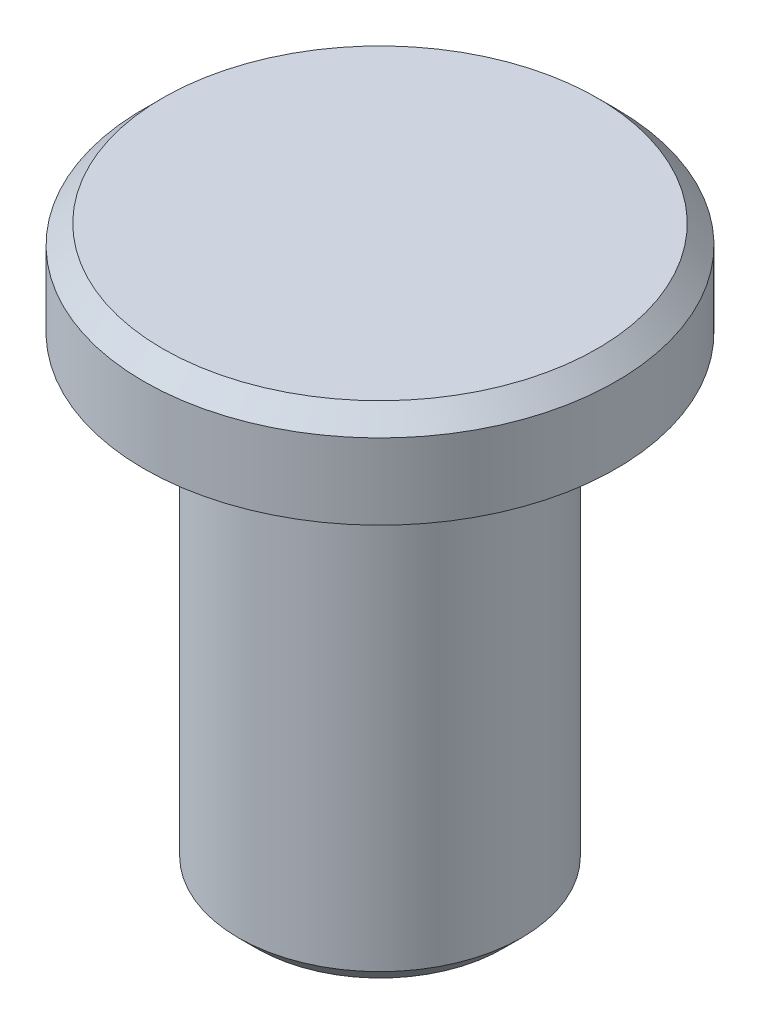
ISO-10303-21;
HEADER;
FILE_DESCRIPTION(('STEP AP214'),'2;1');
FILE_NAME('part.step','',(''),(''),'','','');
FILE_SCHEMA(('AUTOMOTIVE_DESIGN { 1 0 10303 214 1 1 1 1 }'));
ENDSEC;
DATA;
#1=APPLICATION_CONTEXT('core data for automotive mechanical design processes');
#2=APPLICATION_PROTOCOL_DEFINITION('international standard','automotive_design',2000,#1);
#3=PRODUCT_CONTEXT('',#1,'mechanical');
#4=PRODUCT('Part','Part','',(#3));
#5=PRODUCT_RELATED_PRODUCT_CATEGORY('part','',(#4));
#6=PRODUCT_DEFINITION_FORMATION('','',#4);
#7=PRODUCT_DEFINITION_CONTEXT('part definition',#1,'design');
#8=PRODUCT_DEFINITION('design','',#6,#7);
#9=PRODUCT_DEFINITION_SHAPE('','',#8);
#10=(LENGTH_UNIT() NAMED_UNIT(*) SI_UNIT(.MILLI.,.METRE.));
#11=(NAMED_UNIT(*) PLANE_ANGLE_UNIT() SI_UNIT($,.RADIAN.));
#12=(NAMED_UNIT(*) SI_UNIT($,.STERADIAN.) SOLID_ANGLE_UNIT());
#13=UNCERTAINTY_MEASURE_WITH_UNIT(LENGTH_MEASURE(1.E-05),#10,'distance_accuracy_value','');
#14=(GEOMETRIC_REPRESENTATION_CONTEXT(3) GLOBAL_UNCERTAINTY_ASSIGNED_CONTEXT((#13)) GLOBAL_UNIT_ASSIGNED_CONTEXT((#10,
#11,#12)) REPRESENTATION_CONTEXT('',''));
#15=CARTESIAN_POINT('',(0.,0.,0.));
#16=DIRECTION('',(0.,0.,1.));
#17=DIRECTION('',(1.,0.,0.));
#18=AXIS2_PLACEMENT_3D('',#15,#16,#17);
#19=CARTESIAN_POINT('',(0.,5.,0.));
#20=DIRECTION('',(0.,-1.,0.));
#21=DIRECTION('',(0.,0.,-1.));
#22=AXIS2_PLACEMENT_3D('',#19,#20,#21);
#23=CYLINDRICAL_SURFACE('',#22,1.5);
#24=CARTESIAN_POINT('',(0.,0.199999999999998,0.));
#25=DIRECTION('',(0.,1.,0.));
#26=DIRECTION('',(0.,0.,1.));
#27=AXIS2_PLACEMENT_3D('',#24,#25,#26);
#28=CIRCLE('',#27,1.5);
#29=CARTESIAN_POINT('',(0.,0.199999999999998,1.5));
#30=VERTEX_POINT('',#29);
#31=EDGE_CURVE('E41',#30,#30,#28,.T.);
#32=ORIENTED_EDGE('',*,*,#31,.T.);
#33=EDGE_LOOP('',(#32));
#34=FACE_BOUND('',#33,.T.);
#35=CARTESIAN_POINT('',(0.,5.,0.));
#36=DIRECTION('',(0.,1.,0.));
#37=DIRECTION('',(0.,0.,1.));
#38=AXIS2_PLACEMENT_3D('',#35,#36,#37);
#39=CIRCLE('',#38,1.5);
#40=CARTESIAN_POINT('',(0.,5.,1.5));
#41=VERTEX_POINT('',#40);
#42=EDGE_CURVE('E54',#41,#41,#39,.T.);
#43=ORIENTED_EDGE('',*,*,#42,.F.);
#44=EDGE_LOOP('',(#43));
#45=FACE_BOUND('',#44,.T.);
#46=ADVANCED_FACE('F33',(#34,#45),#23,.T.);
#47=CARTESIAN_POINT('',(0.,0.,0.));
#48=DIRECTION('',(0.,1.,0.));
#49=DIRECTION('',(0.,0.,1.));
#50=AXIS2_PLACEMENT_3D('',#47,#48,#49);
#51=PLANE('',#50);
#52=CARTESIAN_POINT('',(0.,0.,0.));
#53=DIRECTION('',(0.,1.,0.));
#54=DIRECTION('',(0.,0.,1.));
#55=AXIS2_PLACEMENT_3D('',#52,#53,#54);
#56=CIRCLE('',#55,1.3);
#57=CARTESIAN_POINT('',(0.,0.,1.3));
#58=VERTEX_POINT('',#57);
#59=EDGE_CURVE('E10',#58,#58,#56,.F.);
#60=ORIENTED_EDGE('',*,*,#59,.T.);
#61=EDGE_LOOP('',(#60));
#62=FACE_BOUND('',#61,.T.);
#63=ADVANCED_FACE('F78',(#62),#51,.F.);
#64=CARTESIAN_POINT('',(0.,6.,0.));
#65=DIRECTION('',(0.,-1.,0.));
#66=DIRECTION('',(0.,0.,-1.));
#67=AXIS2_PLACEMENT_3D('',#64,#65,#66);
#68=CYLINDRICAL_SURFACE('',#67,2.5);
#69=CARTESIAN_POINT('',(0.,5.8,0.));
#70=DIRECTION('',(0.,1.,0.));
#71=DIRECTION('',(0.,0.,1.));
#72=AXIS2_PLACEMENT_3D('',#69,#70,#71);
#73=CIRCLE('',#72,2.5);
#74=CARTESIAN_POINT('',(0.,5.8,2.5));
#75=VERTEX_POINT('',#74);
#76=EDGE_CURVE('E45',#75,#75,#73,.F.);
#77=ORIENTED_EDGE('',*,*,#76,.T.);
#78=EDGE_LOOP('',(#77));
#79=FACE_BOUND('',#78,.T.);
#80=CARTESIAN_POINT('',(0.,5.,0.));
#81=DIRECTION('',(0.,1.,0.));
#82=DIRECTION('',(0.,0.,1.));
#83=AXIS2_PLACEMENT_3D('',#80,#81,#82);
#84=CIRCLE('',#83,2.5);
#85=CARTESIAN_POINT('',(0.,5.,2.5));
#86=VERTEX_POINT('',#85);
#87=EDGE_CURVE('E57',#86,#86,#84,.T.);
#88=ORIENTED_EDGE('',*,*,#87,.T.);
#89=EDGE_LOOP('',(#88));
#90=FACE_BOUND('',#89,.T.);
#91=ADVANCED_FACE('F61',(#79,#90),#68,.T.);
#92=CARTESIAN_POINT('',(0.,6.,0.));
#93=DIRECTION('',(0.,1.,0.));
#94=DIRECTION('',(0.,0.,1.));
#95=AXIS2_PLACEMENT_3D('',#92,#93,#94);
#96=PLANE('',#95);
#97=CARTESIAN_POINT('',(0.,6.,0.));
#98=DIRECTION('',(0.,1.,0.));
#99=DIRECTION('',(0.,0.,1.));
#100=AXIS2_PLACEMENT_3D('',#97,#98,#99);
#101=CIRCLE('',#100,2.3);
#102=CARTESIAN_POINT('',(0.,6.,2.3));
#103=VERTEX_POINT('',#102);
#104=EDGE_CURVE('E49',#103,#103,#101,.T.);
#105=ORIENTED_EDGE('',*,*,#104,.T.);
#106=EDGE_LOOP('',(#105));
#107=FACE_BOUND('',#106,.T.);
#108=ADVANCED_FACE('F66',(#107),#96,.T.);
#109=CARTESIAN_POINT('',(0.,5.,0.));
#110=DIRECTION('',(0.,1.,0.));
#111=DIRECTION('',(0.,0.,1.));
#112=AXIS2_PLACEMENT_3D('',#109,#110,#111);
#113=PLANE('',#112);
#114=ORIENTED_EDGE('',*,*,#42,.T.);
#115=EDGE_LOOP('',(#114));
#116=FACE_BOUND('',#115,.T.);
#117=ORIENTED_EDGE('',*,*,#87,.F.);
#118=EDGE_LOOP('',(#117));
#119=FACE_BOUND('',#118,.T.);
#120=ADVANCED_FACE('F63',(#116,#119),#113,.F.);
#121=CARTESIAN_POINT('',(0.,6.,0.));
#122=DIRECTION('',(0.,-1.,0.));
#123=DIRECTION('',(0.,0.,-1.));
#124=AXIS2_PLACEMENT_3D('',#121,#122,#123);
#125=CONICAL_SURFACE('',#124,2.3,0.785398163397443);
#126=ORIENTED_EDGE('',*,*,#76,.F.);
#127=EDGE_LOOP('',(#126));
#128=FACE_BOUND('',#127,.T.);
#129=ORIENTED_EDGE('',*,*,#104,.F.);
#130=EDGE_LOOP('',(#129));
#131=FACE_BOUND('',#130,.T.);
#132=ADVANCED_FACE('F65',(#128,#131),#125,.T.);
#133=CARTESIAN_POINT('',(0.,0.199999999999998,0.));
#134=DIRECTION('',(0.,1.,0.));
#135=DIRECTION('',(0.,0.,1.));
#136=AXIS2_PLACEMENT_3D('',#133,#134,#135);
#137=CONICAL_SURFACE('',#136,1.5,0.785398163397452);
#138=ORIENTED_EDGE('',*,*,#59,.F.);
#139=EDGE_LOOP('',(#138));
#140=FACE_BOUND('',#139,.T.);
#141=ORIENTED_EDGE('',*,*,#31,.F.);
#142=EDGE_LOOP('',(#141));
#143=FACE_BOUND('',#142,.T.);
#144=ADVANCED_FACE('F36',(#140,#143),#137,.T.);
#145=CLOSED_SHELL('',(#46,#63,#91,#108,#120,#132,#144));
#146=MANIFOLD_SOLID_BREP('B2',#145);
#147=ADVANCED_BREP_SHAPE_REPRESENTATION('',(#18,#146),#14);
#148=SHAPE_DEFINITION_REPRESENTATION(#9,#147);
ENDSEC;
END-ISO-10303-21;
